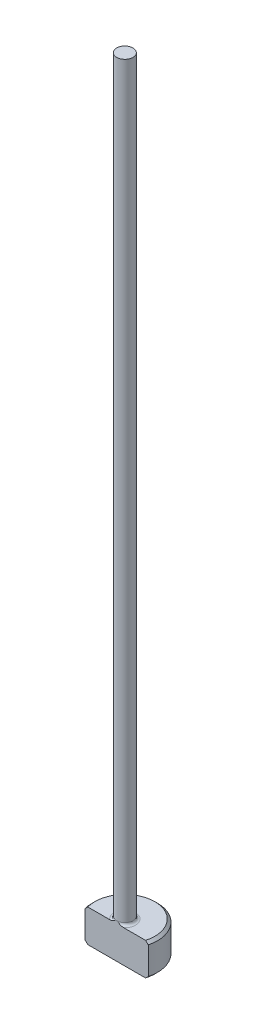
ISO-10303-21;
HEADER;
FILE_DESCRIPTION(('STEP AP214'),'2;1');
FILE_NAME('part.step','',(''),(''),'','','');
FILE_SCHEMA(('AUTOMOTIVE_DESIGN { 1 0 10303 214 1 1 1 1 }'));
ENDSEC;
DATA;
#1=APPLICATION_CONTEXT('core data for automotive mechanical design processes');
#2=APPLICATION_PROTOCOL_DEFINITION('international standard','automotive_design',2000,#1);
#3=PRODUCT_CONTEXT('',#1,'mechanical');
#4=PRODUCT('Part','Part','',(#3));
#5=PRODUCT_RELATED_PRODUCT_CATEGORY('part','',(#4));
#6=PRODUCT_DEFINITION_FORMATION('','',#4);
#7=PRODUCT_DEFINITION_CONTEXT('part definition',#1,'design');
#8=PRODUCT_DEFINITION('design','',#6,#7);
#9=PRODUCT_DEFINITION_SHAPE('','',#8);
#10=(LENGTH_UNIT() NAMED_UNIT(*) SI_UNIT(.MILLI.,.METRE.));
#11=(NAMED_UNIT(*) PLANE_ANGLE_UNIT() SI_UNIT($,.RADIAN.));
#12=(NAMED_UNIT(*) SI_UNIT($,.STERADIAN.) SOLID_ANGLE_UNIT());
#13=UNCERTAINTY_MEASURE_WITH_UNIT(LENGTH_MEASURE(1.E-05),#10,'distance_accuracy_value','');
#14=(GEOMETRIC_REPRESENTATION_CONTEXT(3) GLOBAL_UNCERTAINTY_ASSIGNED_CONTEXT((#13)) GLOBAL_UNIT_ASSIGNED_CONTEXT((#10,
#11,#12)) REPRESENTATION_CONTEXT('',''));
#15=CARTESIAN_POINT('',(0.,0.,0.));
#16=DIRECTION('',(0.,0.,1.));
#17=DIRECTION('',(1.,0.,0.));
#18=AXIS2_PLACEMENT_3D('',#15,#16,#17);
#19=CARTESIAN_POINT('',(0.,0.,0.));
#20=DIRECTION('',(0.,-1.,0.));
#21=DIRECTION('',(0.,0.,-1.));
#22=AXIS2_PLACEMENT_3D('',#19,#20,#21);
#23=PLANE('',#22);
#24=CARTESIAN_POINT('',(0.,0.,0.));
#25=DIRECTION('',(0.,-1.,0.));
#26=DIRECTION('',(0.,0.,-1.));
#27=AXIS2_PLACEMENT_3D('',#24,#25,#26);
#28=CIRCLE('',#27,2.92099999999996);
#29=CARTESIAN_POINT('',(-2.81108554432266,0.,0.793749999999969));
#30=VERTEX_POINT('',#29);
#31=CARTESIAN_POINT('',(2.81108554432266,0.,0.793749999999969));
#32=VERTEX_POINT('',#31);
#33=EDGE_CURVE('E98',#30,#32,#28,.T.);
#34=ORIENTED_EDGE('',*,*,#33,.T.);
#35=DIRECTION('',(-1.,0.,0.));
#36=VECTOR('',#35,1.);
#37=CARTESIAN_POINT('',(-3.07418053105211,0.,0.793749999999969));
#38=LINE('',#37,#36);
#39=EDGE_CURVE('E83',#32,#30,#38,.T.);
#40=ORIENTED_EDGE('',*,*,#39,.T.);
#41=EDGE_LOOP('',(#34,#40));
#42=FACE_BOUND('',#41,.T.);
#43=ADVANCED_FACE('F32',(#42),#23,.T.);
#44=CARTESIAN_POINT('',(0.,259.958771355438,0.));
#45=DIRECTION('',(0.,1.,0.));
#46=DIRECTION('',(0.,0.,1.));
#47=AXIS2_PLACEMENT_3D('',#44,#45,#46);
#48=CYLINDRICAL_SURFACE('',#47,3.17499999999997);
#49=CARTESIAN_POINT('',(0.,2.92099999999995,0.));
#50=DIRECTION('',(0.,1.,0.));
#51=DIRECTION('',(0.,0.,1.));
#52=AXIS2_PLACEMENT_3D('',#49,#50,#51);
#53=CIRCLE('',#52,3.17499999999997);
#54=CARTESIAN_POINT('',(-3.07418053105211,2.92099999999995,0.793749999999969));
#55=VERTEX_POINT('',#54);
#56=CARTESIAN_POINT('',(3.07418053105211,2.92099999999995,0.793749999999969));
#57=VERTEX_POINT('',#56);
#58=EDGE_CURVE('E104',#55,#57,#53,.F.);
#59=ORIENTED_EDGE('',*,*,#58,.T.);
#60=DIRECTION('',(0.,-1.,0.));
#61=VECTOR('',#60,1.);
#62=CARTESIAN_POINT('',(3.07418053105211,76.2,0.793749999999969));
#63=LINE('',#62,#61);
#64=CARTESIAN_POINT('',(3.07418053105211,0.254000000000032,0.793749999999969));
#65=VERTEX_POINT('',#64);
#66=EDGE_CURVE('E183',#57,#65,#63,.T.);
#67=ORIENTED_EDGE('',*,*,#66,.T.);
#68=CARTESIAN_POINT('',(0.,0.254000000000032,0.));
#69=DIRECTION('',(0.,-1.,0.));
#70=DIRECTION('',(0.,0.,-1.));
#71=AXIS2_PLACEMENT_3D('',#68,#69,#70);
#72=CIRCLE('',#71,3.17499999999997);
#73=CARTESIAN_POINT('',(-3.07418053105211,0.254000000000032,0.793749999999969));
#74=VERTEX_POINT('',#73);
#75=EDGE_CURVE('E100',#65,#74,#72,.F.);
#76=ORIENTED_EDGE('',*,*,#75,.T.);
#77=DIRECTION('',(0.,-1.,0.));
#78=VECTOR('',#77,1.);
#79=CARTESIAN_POINT('',(-3.07418053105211,76.2,0.793749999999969));
#80=LINE('',#79,#78);
#81=EDGE_CURVE('E93',#55,#74,#80,.T.);
#82=ORIENTED_EDGE('',*,*,#81,.F.);
#83=EDGE_LOOP('',(#59,#67,#76,#82));
#84=FACE_BOUND('',#83,.T.);
#85=ADVANCED_FACE('F158',(#84),#48,.T.);
#86=CARTESIAN_POINT('',(-3.17499999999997,3.175,0.));
#87=DIRECTION('',(0.,1.,0.));
#88=DIRECTION('',(0.,0.,1.));
#89=AXIS2_PLACEMENT_3D('',#86,#87,#88);
#90=PLANE('',#89);
#91=CARTESIAN_POINT('',(0.,3.175,0.));
#92=DIRECTION('',(0.,1.,0.));
#93=DIRECTION('',(0.,0.,1.));
#94=AXIS2_PLACEMENT_3D('',#91,#92,#93);
#95=CIRCLE('',#94,2.92099999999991);
#96=CARTESIAN_POINT('',(2.81108554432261,3.175,0.793749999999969));
#97=VERTEX_POINT('',#96);
#98=CARTESIAN_POINT('',(-2.81108554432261,3.175,0.793749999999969));
#99=VERTEX_POINT('',#98);
#100=EDGE_CURVE('E178',#97,#99,#95,.T.);
#101=ORIENTED_EDGE('',*,*,#100,.T.);
#102=DIRECTION('',(1.,0.,0.));
#103=VECTOR('',#102,1.);
#104=CARTESIAN_POINT('',(-3.17499999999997,3.175,0.793749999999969));
#105=LINE('',#104,#103);
#106=CARTESIAN_POINT('',(-0.68391593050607,3.17500000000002,0.793749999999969));
#107=VERTEX_POINT('',#106);
#108=EDGE_CURVE('E57',#99,#107,#105,.T.);
#109=ORIENTED_EDGE('',*,*,#108,.T.);
#110=CARTESIAN_POINT('',(0.,3.175,0.));
#111=DIRECTION('',(0.,1.,0.));
#112=DIRECTION('',(0.,0.,1.));
#113=AXIS2_PLACEMENT_3D('',#110,#111,#112);
#114=CIRCLE('',#113,1.04774999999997);
#115=CARTESIAN_POINT('',(0.683915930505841,3.17500000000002,0.793749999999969));
#116=VERTEX_POINT('',#115);
#117=EDGE_CURVE('E107',#107,#116,#114,.F.);
#118=ORIENTED_EDGE('',*,*,#117,.T.);
#119=EDGE_CURVE('E136',#116,#97,#105,.T.);
#120=ORIENTED_EDGE('',*,*,#119,.T.);
#121=EDGE_LOOP('',(#101,#109,#118,#120));
#122=FACE_BOUND('',#121,.T.);
#123=ADVANCED_FACE('F147',(#122),#90,.T.);
#124=CARTESIAN_POINT('',(0.,3.17499999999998,0.));
#125=DIRECTION('',(0.,-1.,0.));
#126=DIRECTION('',(0.,0.,-1.));
#127=AXIS2_PLACEMENT_3D('',#124,#125,#126);
#128=CONICAL_SURFACE('',#127,2.92099999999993,0.78539816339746);
#129=ORIENTED_EDGE('',*,*,#58,.F.);
#130=CARTESIAN_POINT('',(-6.76654378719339,-0.716940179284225,0.793749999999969));
#131=CARTESIAN_POINT('',(-6.58612847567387,-0.537757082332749,0.793749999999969));
#132=CARTESIAN_POINT('',(-6.40566799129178,-0.358619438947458,0.793749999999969));
#133=CARTESIAN_POINT('',(-6.04458522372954,-0.000434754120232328,0.793749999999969));
#134=CARTESIAN_POINT('',(-5.86396291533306,0.178612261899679,0.793749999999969));
#135=CARTESIAN_POINT('',(-5.5018107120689,0.537283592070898,0.793749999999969));
#136=CARTESIAN_POINT('',(-5.32028015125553,0.716907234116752,0.793749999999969));
#137=CARTESIAN_POINT('',(-4.95703332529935,1.07589430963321,0.793749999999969));
#138=CARTESIAN_POINT('',(-4.77531710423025,1.25525778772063,0.793749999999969));
#139=CARTESIAN_POINT('',(-4.30046081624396,1.72319332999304,0.793749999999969));
#140=CARTESIAN_POINT('',(-4.00708464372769,2.0115263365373,0.793749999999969));
#141=CARTESIAN_POINT('',(-3.56582498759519,2.44302479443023,0.793749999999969));
#142=CARTESIAN_POINT('',(-3.41848369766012,2.58674450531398,0.793749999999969));
#143=CARTESIAN_POINT('',(-3.12328201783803,2.87362456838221,0.793749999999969));
#144=CARTESIAN_POINT('',(-2.97542167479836,3.01678496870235,0.793749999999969));
#145=CARTESIAN_POINT('',(-2.67948713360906,3.3017024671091,0.793749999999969));
#146=CARTESIAN_POINT('',(-2.53141613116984,3.44346288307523,0.793749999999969));
#147=CARTESIAN_POINT('',(-2.23395385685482,3.72569854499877,0.793749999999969));
#148=CARTESIAN_POINT('',(-2.08456216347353,3.86617334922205,0.793749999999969));
#149=CARTESIAN_POINT('',(-1.85887536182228,4.07494512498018,0.793749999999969));
#150=CARTESIAN_POINT('',(-1.78343405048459,4.14416382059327,0.793749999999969));
#151=CARTESIAN_POINT('',(-1.63175147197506,4.28171769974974,0.793749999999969));
#152=CARTESIAN_POINT('',(-1.55551023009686,4.35005291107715,0.793749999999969));
#153=CARTESIAN_POINT('',(-1.40191671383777,4.48538182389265,0.793749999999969));
#154=CARTESIAN_POINT('',(-1.32456505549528,4.55237622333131,0.793749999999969));
#155=CARTESIAN_POINT('',(-1.16814829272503,4.68432749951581,0.793749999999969));
#156=CARTESIAN_POINT('',(-1.08908357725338,4.74928483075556,0.793749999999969));
#157=CARTESIAN_POINT('',(-0.97864625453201,4.83605857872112,0.793749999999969));
#158=CARTESIAN_POINT('',(-0.948460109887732,4.85938268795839,0.793749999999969));
#159=CARTESIAN_POINT('',(-0.887614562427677,4.9054118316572,0.793749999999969));
#160=CARTESIAN_POINT('',(-0.85695512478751,4.9281168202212,0.793749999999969));
#161=CARTESIAN_POINT('',(-0.794984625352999,4.97280020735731,0.793749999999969));
#162=CARTESIAN_POINT('',(-0.763672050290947,4.9947765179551,0.793749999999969));
#163=CARTESIAN_POINT('',(-0.700352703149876,5.03770392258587,0.793749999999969));
#164=CARTESIAN_POINT('',(-0.668345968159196,5.05865507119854,0.793749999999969));
#165=CARTESIAN_POINT('',(-0.604596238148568,5.09851389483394,0.793749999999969));
#166=CARTESIAN_POINT('',(-0.572882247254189,5.11746713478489,0.793749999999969));
#167=CARTESIAN_POINT('',(-0.508518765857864,5.15370377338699,0.793749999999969));
#168=CARTESIAN_POINT('',(-0.475868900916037,5.17098649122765,0.793749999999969));
#169=CARTESIAN_POINT('',(-0.37652619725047,5.21937397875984,0.793749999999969));
#170=CARTESIAN_POINT('',(-0.308073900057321,5.24726182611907,0.793749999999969));
#171=CARTESIAN_POINT('',(-0.214532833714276,5.27405975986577,0.793749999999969));
#172=CARTESIAN_POINT('',(-0.191393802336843,5.27981785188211,0.793749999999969));
#173=CARTESIAN_POINT('',(-0.144729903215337,5.28948827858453,0.793749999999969));
#174=CARTESIAN_POINT('',(-0.121204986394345,5.29340037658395,0.793749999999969));
#175=CARTESIAN_POINT('',(-0.0504134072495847,5.30201256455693,0.793749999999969));
#176=CARTESIAN_POINT('',(-0.00272310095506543,5.30365123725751,0.793749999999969));
#177=CARTESIAN_POINT('',(0.0920811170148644,5.29833583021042,0.793749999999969));
#178=CARTESIAN_POINT('',(0.139195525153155,5.2913897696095,0.793749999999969));
#179=CARTESIAN_POINT('',(0.231925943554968,5.2703074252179,0.793749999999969));
#180=CARTESIAN_POINT('',(0.277534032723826,5.25613809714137,0.793749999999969));
#181=CARTESIAN_POINT('',(0.379024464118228,5.21798849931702,0.793749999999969));
#182=CARTESIAN_POINT('',(0.434273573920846,5.1923804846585,0.793749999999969));
#183=CARTESIAN_POINT('',(0.542067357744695,5.13591410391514,0.793749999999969));
#184=CARTESIAN_POINT('',(0.594605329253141,5.10504346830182,0.793749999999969));
#185=CARTESIAN_POINT('',(0.697964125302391,5.03978970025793,0.793749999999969));
#186=CARTESIAN_POINT('',(0.748769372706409,5.00538227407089,0.793749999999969));
#187=CARTESIAN_POINT('',(0.848768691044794,4.93444453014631,0.793749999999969));
#188=CARTESIAN_POINT('',(0.897964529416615,4.89791667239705,0.793749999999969));
#189=CARTESIAN_POINT('',(1.00110200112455,4.81888727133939,0.793749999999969));
#190=CARTESIAN_POINT('',(1.05489843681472,4.77619738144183,0.793749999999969));
#191=CARTESIAN_POINT('',(1.1614670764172,4.68955385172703,0.793749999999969));
#192=CARTESIAN_POINT('',(1.21423916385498,4.64560006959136,0.793749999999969));
#193=CARTESIAN_POINT('',(1.37147314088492,4.51238432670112,0.793749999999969));
#194=CARTESIAN_POINT('',(1.47481171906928,4.42180042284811,0.793749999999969));
#195=CARTESIAN_POINT('',(1.6799072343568,4.23856991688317,0.793749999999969));
#196=CARTESIAN_POINT('',(1.78166152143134,4.14592038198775,0.793749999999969));
#197=CARTESIAN_POINT('',(1.98403605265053,3.95943864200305,0.793749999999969));
#198=CARTESIAN_POINT('',(2.08465655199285,3.86560671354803,0.793749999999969));
#199=CARTESIAN_POINT('',(2.28470036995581,3.67758310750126,0.793749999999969));
#200=CARTESIAN_POINT('',(2.38412704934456,3.58339499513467,0.793749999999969));
#201=CARTESIAN_POINT('',(2.58246726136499,3.39446890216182,0.793749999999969));
#202=CARTESIAN_POINT('',(2.68138076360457,3.29973088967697,0.793749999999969));
#203=CARTESIAN_POINT('',(2.97740330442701,3.01509017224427,0.793749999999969));
#204=CARTESIAN_POINT('',(3.17395519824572,2.82460855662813,0.793749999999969));
#205=CARTESIAN_POINT('',(3.65457059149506,2.35679110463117,0.793749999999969));
#206=CARTESIAN_POINT('',(3.93817207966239,2.078981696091,0.793749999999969));
#207=CARTESIAN_POINT('',(4.5045437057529,1.52234859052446,0.793749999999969));
#208=CARTESIAN_POINT('',(4.78731356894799,1.24352461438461,0.793749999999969));
#209=CARTESIAN_POINT('',(5.35306828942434,0.684582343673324,0.793749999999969));
#210=CARTESIAN_POINT('',(5.63605169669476,0.404462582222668,0.793749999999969));
#211=CARTESIAN_POINT('',(6.20156797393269,-0.156054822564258,0.793749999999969));
#212=CARTESIAN_POINT('',(6.48410095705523,-0.436452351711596,0.793749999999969));
#213=CARTESIAN_POINT('',(6.76654378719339,-0.716940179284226,0.793749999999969));
#214=B_SPLINE_CURVE_WITH_KNOTS('',3,(#130,#131,#132,#133,#134,#135,#136,#137,#138,#139,#140,
#141,#142,#143,#144,#145,#146,#147,#148,#149,#150,#151,#152,#153,#154,#155,#156,#157,#158,#159,
#160,#161,#162,#163,#164,#165,#166,#167,#168,#169,#170,#171,#172,#173,#174,#175,#176,#177,#178,
#179,#180,#181,#182,#183,#184,#185,#186,#187,#188,#189,#190,#191,#192,#193,#194,#195,#196,#197,
#198,#199,#200,#201,#202,#203,#204,#205,#206,#207,#208,#209,#210,#211,#212,#213),.UNSPECIFIED.,
.F.,.F.,(4,2,2,2,2,2,2,2,2,2,2,2,2,2,2,2,2,2,2,2,2,2,2,2,2,2,2,2,2,2,2,2,2,2,2,2,2,2,2,2,2,4),
(0.,0.762827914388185,1.52580903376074,2.29194326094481,3.05792523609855,4.29195946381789,
4.90944009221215,5.52686635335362,6.14183419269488,6.75700594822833,7.06415568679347,
7.37129574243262,7.67827152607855,7.98517832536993,8.09961411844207,8.2140583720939,
8.32880631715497,8.4435481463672,8.55433096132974,8.66515873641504,8.8854990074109,
8.95696802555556,9.02844620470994,9.17076254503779,9.31294604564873,9.45578590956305,
9.63799856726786,9.82064200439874,10.0046365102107,10.1884216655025,10.3944233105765,
10.6004482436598,11.0126549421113,11.4254897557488,11.8382297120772,12.249096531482,
12.6599874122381,13.4811048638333,14.6720966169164,15.8634454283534,17.0579826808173,
18.2521466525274),.UNSPECIFIED.);
#215=EDGE_CURVE('E135',#55,#99,#214,.T.);
#216=ORIENTED_EDGE('',*,*,#215,.T.);
#217=ORIENTED_EDGE('',*,*,#100,.F.);
#218=EDGE_CURVE('E127',#97,#57,#214,.T.);
#219=ORIENTED_EDGE('',*,*,#218,.T.);
#220=EDGE_LOOP('',(#129,#216,#217,#219));
#221=FACE_BOUND('',#220,.T.);
#222=ADVANCED_FACE('F143',(#221),#128,.T.);
#223=CARTESIAN_POINT('',(0.,0.254000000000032,0.));
#224=DIRECTION('',(0.,1.,0.));
#225=DIRECTION('',(0.,0.,1.));
#226=AXIS2_PLACEMENT_3D('',#223,#224,#225);
#227=CONICAL_SURFACE('',#226,3.17499999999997,0.785398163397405);
#228=ORIENTED_EDGE('',*,*,#75,.F.);
#229=CARTESIAN_POINT('',(6.76654378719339,3.89194017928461,0.793749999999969));
#230=CARTESIAN_POINT('',(6.5861284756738,3.71275708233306,0.793749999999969));
#231=CARTESIAN_POINT('',(6.40566799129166,3.53361943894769,0.793749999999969));
#232=CARTESIAN_POINT('',(6.0445852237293,3.1754347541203,0.793749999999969));
#233=CARTESIAN_POINT('',(5.86396291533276,2.99638773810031,0.793749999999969));
#234=CARTESIAN_POINT('',(5.50181071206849,2.63771640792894,0.793749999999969));
#235=CARTESIAN_POINT('',(5.32028015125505,2.458092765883,0.793749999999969));
#236=CARTESIAN_POINT('',(4.95703332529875,2.09910569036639,0.793749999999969));
#237=CARTESIAN_POINT('',(4.77531710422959,1.91974221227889,0.793749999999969));
#238=CARTESIAN_POINT('',(4.30046081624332,1.45180667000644,0.793749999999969));
#239=CARTESIAN_POINT('',(4.00708464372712,1.16347366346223,0.793749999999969));
#240=CARTESIAN_POINT('',(3.56582498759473,0.731975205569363,0.793749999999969));
#241=CARTESIAN_POINT('',(3.41848369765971,0.588255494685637,0.793749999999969));
#242=CARTESIAN_POINT('',(3.12328201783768,0.301375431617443,0.793749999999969));
#243=CARTESIAN_POINT('',(2.97542167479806,0.158215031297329,0.793749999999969));
#244=CARTESIAN_POINT('',(2.67948713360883,-0.126702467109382,0.793749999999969));
#245=CARTESIAN_POINT('',(2.53141613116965,-0.268462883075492,0.793749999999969));
#246=CARTESIAN_POINT('',(2.2339538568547,-0.550698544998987,0.793749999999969));
#247=CARTESIAN_POINT('',(2.08456216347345,-0.691173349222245,0.793749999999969));
#248=CARTESIAN_POINT('',(1.85887536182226,-0.899945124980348,0.793749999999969));
#249=CARTESIAN_POINT('',(1.78343405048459,-0.969163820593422,0.793749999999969));
#250=CARTESIAN_POINT('',(1.63175147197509,-1.10671769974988,0.793749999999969));
#251=CARTESIAN_POINT('',(1.55551023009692,-1.17505291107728,0.793749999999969));
#252=CARTESIAN_POINT('',(1.40191671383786,-1.31038182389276,0.793749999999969));
#253=CARTESIAN_POINT('',(1.32456505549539,-1.37737622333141,0.793749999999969));
#254=CARTESIAN_POINT('',(1.16814829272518,-1.5093274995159,0.793749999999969));
#255=CARTESIAN_POINT('',(1.08908357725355,-1.57428483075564,0.793749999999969));
#256=CARTESIAN_POINT('',(0.978646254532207,-1.6610585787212,0.793749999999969));
#257=CARTESIAN_POINT('',(0.948460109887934,-1.68438268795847,0.793749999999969));
#258=CARTESIAN_POINT('',(0.887614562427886,-1.73041183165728,0.793749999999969));
#259=CARTESIAN_POINT('',(0.856955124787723,-1.75311682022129,0.793749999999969));
#260=CARTESIAN_POINT('',(0.79498462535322,-1.7978002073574,0.793749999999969));
#261=CARTESIAN_POINT('',(0.763672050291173,-1.81977651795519,0.793749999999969));
#262=CARTESIAN_POINT('',(0.700352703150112,-1.86270392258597,0.793749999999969));
#263=CARTESIAN_POINT('',(0.668345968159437,-1.88365507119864,0.793749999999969));
#264=CARTESIAN_POINT('',(0.604596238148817,-1.92351389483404,0.793749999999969));
#265=CARTESIAN_POINT('',(0.572882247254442,-1.942467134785,0.793749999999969));
#266=CARTESIAN_POINT('',(0.508518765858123,-1.97870377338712,0.793749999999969));
#267=CARTESIAN_POINT('',(0.475868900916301,-1.99598649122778,0.793749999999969));
#268=CARTESIAN_POINT('',(0.376526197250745,-2.04437397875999,0.793749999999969));
#269=CARTESIAN_POINT('',(0.308073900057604,-2.07226182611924,0.793749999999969));
#270=CARTESIAN_POINT('',(0.214532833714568,-2.09905975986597,0.793749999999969));
#271=CARTESIAN_POINT('',(0.191393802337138,-2.10481785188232,0.793749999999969));
#272=CARTESIAN_POINT('',(0.144729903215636,-2.11448827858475,0.793749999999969));
#273=CARTESIAN_POINT('',(0.121204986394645,-2.11840037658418,0.793749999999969));
#274=CARTESIAN_POINT('',(0.0504134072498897,-2.12701256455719,0.793749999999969));
#275=CARTESIAN_POINT('',(0.00272310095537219,-2.12865123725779,0.793749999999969));
#276=CARTESIAN_POINT('',(-0.092081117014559,-2.12333583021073,0.793749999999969));
#277=CARTESIAN_POINT('',(-0.139195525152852,-2.11638976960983,0.793749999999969));
#278=CARTESIAN_POINT('',(-0.231925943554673,-2.09530742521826,0.793749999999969));
#279=CARTESIAN_POINT('',(-0.277534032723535,-2.08113809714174,0.793749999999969));
#280=CARTESIAN_POINT('',(-0.379024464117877,-2.04298849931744,0.793749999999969));
#281=CARTESIAN_POINT('',(-0.434273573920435,-2.01738048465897,0.793749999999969));
#282=CARTESIAN_POINT('',(-0.542067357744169,-1.9609141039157,0.793749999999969));
#283=CARTESIAN_POINT('',(-0.594605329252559,-1.93004346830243,0.793749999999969));
#284=CARTESIAN_POINT('',(-0.6979641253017,-1.86478970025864,0.793749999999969));
#285=CARTESIAN_POINT('',(-0.748769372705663,-1.83038227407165,0.793749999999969));
#286=CARTESIAN_POINT('',(-0.848768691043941,-1.75944453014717,0.793749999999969));
#287=CARTESIAN_POINT('',(-0.897964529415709,-1.72291667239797,0.793749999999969));
#288=CARTESIAN_POINT('',(-1.00110200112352,-1.64388727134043,0.793749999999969));
#289=CARTESIAN_POINT('',(-1.05489843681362,-1.60119738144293,0.793749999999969));
#290=CARTESIAN_POINT('',(-1.16146707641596,-1.51455385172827,0.793749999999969));
#291=CARTESIAN_POINT('',(-1.21423916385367,-1.47060006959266,0.793749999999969));
#292=CARTESIAN_POINT('',(-1.3714731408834,-1.33738432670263,0.793749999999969));
#293=CARTESIAN_POINT('',(-1.47481171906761,-1.24680042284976,0.793749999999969));
#294=CARTESIAN_POINT('',(-1.67990723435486,-1.06356991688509,0.793749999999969));
#295=CARTESIAN_POINT('',(-1.78166152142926,-0.970920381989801,0.793749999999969));
#296=CARTESIAN_POINT('',(-1.98403605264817,-0.784438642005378,0.793749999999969));
#297=CARTESIAN_POINT('',(-2.08465655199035,-0.690606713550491,0.793749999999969));
#298=CARTESIAN_POINT('',(-2.28470036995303,-0.502583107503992,0.793749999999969));
#299=CARTESIAN_POINT('',(-2.38412704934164,-0.408394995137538,0.793749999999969));
#300=CARTESIAN_POINT('',(-2.58246726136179,-0.219468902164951,0.793749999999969));
#301=CARTESIAN_POINT('',(-2.68138076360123,-0.124730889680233,0.793749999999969));
#302=CARTESIAN_POINT('',(-2.97740330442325,0.159909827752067,0.793749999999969));
#303=CARTESIAN_POINT('',(-3.17395519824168,0.350391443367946,0.793749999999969));
#304=CARTESIAN_POINT('',(-3.65457059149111,0.818208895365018,0.793749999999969));
#305=CARTESIAN_POINT('',(-3.93817207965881,1.09601830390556,0.793749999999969));
#306=CARTESIAN_POINT('',(-4.50454370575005,1.65265140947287,0.793749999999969));
#307=CARTESIAN_POINT('',(-4.78731356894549,1.9314753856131,0.793749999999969));
#308=CARTESIAN_POINT('',(-5.35306828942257,2.49041765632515,0.793749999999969));
#309=CARTESIAN_POINT('',(-5.63605169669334,2.77053741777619,0.793749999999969));
#310=CARTESIAN_POINT('',(-6.20156797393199,3.33105482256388,0.793749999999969));
#311=CARTESIAN_POINT('',(-6.48410095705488,3.6114523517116,0.793749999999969));
#312=CARTESIAN_POINT('',(-6.76654378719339,3.89194017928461,0.793749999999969));
#313=B_SPLINE_CURVE_WITH_KNOTS('',3,(#229,#230,#231,#232,#233,#234,#235,#236,#237,#238,#239,
#240,#241,#242,#243,#244,#245,#246,#247,#248,#249,#250,#251,#252,#253,#254,#255,#256,#257,#258,
#259,#260,#261,#262,#263,#264,#265,#266,#267,#268,#269,#270,#271,#272,#273,#274,#275,#276,#277,
#278,#279,#280,#281,#282,#283,#284,#285,#286,#287,#288,#289,#290,#291,#292,#293,#294,#295,#296,
#297,#298,#299,#300,#301,#302,#303,#304,#305,#306,#307,#308,#309,#310,#311,#312),.UNSPECIFIED.,
.F.,.F.,(4,2,2,2,2,2,2,2,2,2,2,2,2,2,2,2,2,2,2,2,2,2,2,2,2,2,2,2,2,2,2,2,2,2,2,2,2,2,2,2,2,4),
(0.,0.762827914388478,1.52580903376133,2.29194326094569,3.05792523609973,4.29195946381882,
4.90944009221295,5.5268663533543,6.14183419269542,6.75700594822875,7.06415568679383,
7.37129574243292,7.6782715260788,7.98517832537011,8.09961411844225,8.21405837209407,
8.32880631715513,8.44354814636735,8.55433096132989,8.66515873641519,8.88549900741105,
8.95696802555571,9.02844620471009,9.17076254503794,9.31294604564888,9.4557859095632,
9.6379985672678,9.82064200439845,10.0046365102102,10.1884216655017,10.3944233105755,
10.6004482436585,11.0126549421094,11.4254897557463,11.8382297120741,12.2490965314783,
12.6599874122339,13.4811048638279,14.6720966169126,15.8634454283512,17.0579826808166,
18.2521466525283),.UNSPECIFIED.);
#314=EDGE_CURVE('E86',#65,#32,#313,.T.);
#315=ORIENTED_EDGE('',*,*,#314,.T.);
#316=ORIENTED_EDGE('',*,*,#33,.F.);
#317=EDGE_CURVE('E89',#30,#74,#313,.T.);
#318=ORIENTED_EDGE('',*,*,#317,.T.);
#319=EDGE_LOOP('',(#228,#315,#316,#318));
#320=FACE_BOUND('',#319,.T.);
#321=ADVANCED_FACE('F97',(#320),#227,.T.);
#322=CARTESIAN_POINT('',(0.,3.42900000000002,0.));
#323=DIRECTION('',(0.,1.,0.));
#324=DIRECTION('',(0.,0.,1.));
#325=AXIS2_PLACEMENT_3D('',#322,#323,#324);
#326=TOROIDAL_SURFACE('',#325,1.04774999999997,0.254);
#327=CARTESIAN_POINT('',(0.,3.42900000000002,0.793749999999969));
#328=CARTESIAN_POINT('',(1.00594079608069E-09,3.42900059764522,0.793749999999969));
#329=CARTESIAN_POINT('',(8.25543157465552E-08,3.42900119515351,0.793749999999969));
#330=CARTESIAN_POINT('',(3.59845202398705E-07,3.42900236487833,0.793749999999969));
#331=CARTESIAN_POINT('',(5.56611928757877E-07,3.42900293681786,0.793749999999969));
#332=CARTESIAN_POINT('',(1.03793284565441E-06,3.4290040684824,0.793749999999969));
#333=CARTESIAN_POINT('',(1.32565590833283E-06,3.42900462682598,0.793749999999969));
#334=CARTESIAN_POINT('',(1.96199956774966E-06,3.42900570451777,0.793749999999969));
#335=CARTESIAN_POINT('',(2.31046733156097E-06,3.42900622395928,0.793749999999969));
#336=CARTESIAN_POINT('',(3.51238455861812E-06,3.42900787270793,0.793749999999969));
#337=CARTESIAN_POINT('',(4.44738387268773E-06,3.42900894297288,0.793749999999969));
#338=CARTESIAN_POINT('',(6.43338758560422E-06,3.42901092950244,0.793749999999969));
#339=CARTESIAN_POINT('',(7.48242245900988E-06,3.42901184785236,0.793749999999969));
#340=CARTESIAN_POINT('',(1.1352686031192E-05,3.42901504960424,0.793749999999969));
#341=CARTESIAN_POINT('',(1.43190067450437E-05,3.42901716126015,0.793749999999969));
#342=CARTESIAN_POINT('',(2.0344879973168E-05,3.42902083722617,0.793749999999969));
#343=CARTESIAN_POINT('',(2.33909441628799E-05,3.42902242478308,0.793749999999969));
#344=CARTESIAN_POINT('',(3.56627691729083E-05,3.42902869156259,0.793749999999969));
#345=CARTESIAN_POINT('',(4.4989192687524E-05,3.42903316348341,0.793749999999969));
#346=CARTESIAN_POINT('',(6.2853777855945E-05,3.42904079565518,0.793749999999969));
#347=CARTESIAN_POINT('',(7.13510645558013E-05,3.42904404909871,0.793749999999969));
#348=CARTESIAN_POINT('',(0.000129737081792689,3.42906834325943,0.793749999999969));
#349=CARTESIAN_POINT('',(0.00017577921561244,3.42909753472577,0.793749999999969));
#350=CARTESIAN_POINT('',(0.000350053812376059,3.42920359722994,0.793749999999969));
#351=CARTESIAN_POINT('',(0.00048099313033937,3.42927442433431,0.793749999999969));
#352=CARTESIAN_POINT('',(0.000972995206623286,3.42954494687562,0.793749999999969));
#353=CARTESIAN_POINT('',(0.00133127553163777,3.4297509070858,0.793749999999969));
#354=CARTESIAN_POINT('',(0.00275914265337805,3.43056728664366,0.793749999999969));
#355=CARTESIAN_POINT('',(0.00383182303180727,3.43117068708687,0.793749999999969));
#356=CARTESIAN_POINT('',(0.0249852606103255,3.44307504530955,0.793749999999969));
#357=CARTESIAN_POINT('',(0.0450341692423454,3.45445024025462,0.793749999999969));
#358=CARTESIAN_POINT('',(0.0846093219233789,3.47663493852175,0.793749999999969));
#359=CARTESIAN_POINT('',(0.10413206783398,3.48745096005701,0.793749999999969));
#360=CARTESIAN_POINT('',(0.145314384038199,3.50987127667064,0.793749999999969));
#361=CARTESIAN_POINT('',(0.166990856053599,3.52144503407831,0.793749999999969));
#362=CARTESIAN_POINT('',(0.210829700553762,3.54412234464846,0.793749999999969));
#363=CARTESIAN_POINT('',(0.232994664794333,3.55522089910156,0.793749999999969));
#364=CARTESIAN_POINT('',(0.289745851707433,3.58237702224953,0.793749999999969));
#365=CARTESIAN_POINT('',(0.324598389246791,3.59788963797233,0.793749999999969));
#366=CARTESIAN_POINT('',(0.394732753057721,3.62578193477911,0.793749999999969));
#367=CARTESIAN_POINT('',(0.429990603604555,3.63822002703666,0.793749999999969));
#368=CARTESIAN_POINT('',(0.486020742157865,3.65466140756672,0.793749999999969));
#369=CARTESIAN_POINT('',(0.506403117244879,3.65997735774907,0.793749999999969));
#370=CARTESIAN_POINT('',(0.547581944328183,3.66916489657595,0.793749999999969));
#371=CARTESIAN_POINT('',(0.568379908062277,3.67302947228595,0.793749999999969));
#372=CARTESIAN_POINT('',(0.632823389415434,3.68222555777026,0.793749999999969));
#373=CARTESIAN_POINT('',(0.677005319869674,3.6846711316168,0.793749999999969));
#374=CARTESIAN_POINT('',(0.74175190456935,3.68045811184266,0.793749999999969));
#375=CARTESIAN_POINT('',(0.762598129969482,3.67788777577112,0.793749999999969));
#376=CARTESIAN_POINT('',(0.803620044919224,3.66996519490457,0.793749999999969));
#377=CARTESIAN_POINT('',(0.823799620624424,3.66463419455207,0.793749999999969));
#378=CARTESIAN_POINT('',(0.863382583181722,3.65071566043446,0.793749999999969));
#379=CARTESIAN_POINT('',(0.882769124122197,3.64207900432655,0.793749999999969));
#380=CARTESIAN_POINT('',(0.919550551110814,3.62121223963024,0.793749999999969));
#381=CARTESIAN_POINT('',(0.936947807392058,3.6089864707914,0.793749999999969));
#382=CARTESIAN_POINT('',(0.962807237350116,3.5859668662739,0.793749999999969));
#383=CARTESIAN_POINT('',(0.972229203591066,3.57624640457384,0.793749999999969));
#384=CARTESIAN_POINT('',(0.989372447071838,3.55540033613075,0.793749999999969));
#385=CARTESIAN_POINT('',(0.997095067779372,3.54427585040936,0.793749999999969));
#386=CARTESIAN_POINT('',(1.01049428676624,3.52073386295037,0.793749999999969));
#387=CARTESIAN_POINT('',(1.01615519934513,3.50830733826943,0.793749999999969));
#388=CARTESIAN_POINT('',(1.02498233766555,3.48259444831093,0.793749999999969));
#389=CARTESIAN_POINT('',(1.02815025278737,3.46930867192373,0.793749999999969));
#390=CARTESIAN_POINT('',(1.03155096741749,3.44397291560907,0.793749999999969));
#391=CARTESIAN_POINT('',(1.03208709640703,3.43196305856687,0.793749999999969));
#392=CARTESIAN_POINT('',(1.03101637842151,3.40804163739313,0.793749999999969));
#393=CARTESIAN_POINT('',(1.02941018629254,3.39613004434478,0.793749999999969));
#394=CARTESIAN_POINT('',(1.02428560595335,3.37336758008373,0.793749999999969));
#395=CARTESIAN_POINT('',(1.02086846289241,3.36249356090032,0.793749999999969));
#396=CARTESIAN_POINT('',(1.01236081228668,3.34142542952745,0.793749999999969));
#397=CARTESIAN_POINT('',(1.00727011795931,3.33123139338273,0.793749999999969));
#398=CARTESIAN_POINT('',(0.995273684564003,3.31111130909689,0.793749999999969));
#399=CARTESIAN_POINT('',(0.988275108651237,3.30124089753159,0.793749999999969));
#400=CARTESIAN_POINT('',(0.972923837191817,3.28262339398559,0.793749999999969));
#401=CARTESIAN_POINT('',(0.964570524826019,3.27387681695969,0.793749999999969));
#402=CARTESIAN_POINT('',(0.943078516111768,3.25417715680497,0.793749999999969));
#403=CARTESIAN_POINT('',(0.929393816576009,3.24381776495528,0.793749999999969));
#404=CARTESIAN_POINT('',(0.900512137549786,3.2254571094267,0.793749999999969));
#405=CARTESIAN_POINT('',(0.885311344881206,3.21746200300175,0.793749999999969));
#406=CARTESIAN_POINT('',(0.848269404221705,3.20122250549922,0.793749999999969));
#407=CARTESIAN_POINT('',(0.826012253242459,3.19393028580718,0.793749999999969));
#408=CARTESIAN_POINT('',(0.780723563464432,3.18300053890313,0.793749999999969));
#409=CARTESIAN_POINT('',(0.75769381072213,3.17935511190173,0.793749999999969));
#410=CARTESIAN_POINT('',(0.699883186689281,3.17409624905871,0.793749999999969));
#411=CARTESIAN_POINT('',(0.664934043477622,3.17438476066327,0.793749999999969));
#412=CARTESIAN_POINT('',(0.594912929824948,3.18030030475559,0.793749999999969));
#413=CARTESIAN_POINT('',(0.559851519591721,3.18602988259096,0.793749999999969));
#414=CARTESIAN_POINT('',(0.482838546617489,3.20336698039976,0.793749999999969));
#415=CARTESIAN_POINT('',(0.44112931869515,3.2160134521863,0.793749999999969));
#416=CARTESIAN_POINT('',(0.359235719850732,3.24555160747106,0.793749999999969));
#417=CARTESIAN_POINT('',(0.319054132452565,3.26245064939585,0.793749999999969));
#418=CARTESIAN_POINT('',(0.243269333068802,3.29746035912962,0.793749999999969));
#419=CARTESIAN_POINT('',(0.207563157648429,3.31535360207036,0.793749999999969));
#420=CARTESIAN_POINT('',(0.137215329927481,3.35230149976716,0.793749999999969));
#421=CARTESIAN_POINT('',(0.102566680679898,3.37134307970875,0.793749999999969));
#422=CARTESIAN_POINT('',(0.058815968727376,3.39581599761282,0.793749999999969));
#423=CARTESIAN_POINT('',(0.0495777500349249,3.4010080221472,0.793749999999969));
#424=CARTESIAN_POINT('',(0.0342003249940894,3.40966841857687,0.793749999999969));
#425=CARTESIAN_POINT('',(0.0280584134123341,3.41313227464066,0.793749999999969));
#426=CARTESIAN_POINT('',(0.0162490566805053,3.41981335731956,0.793749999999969));
#427=CARTESIAN_POINT('',(0.0105810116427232,3.4230293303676,0.793749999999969));
#428=CARTESIAN_POINT('',(0.00384046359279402,3.42682478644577,0.793749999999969));
#429=CARTESIAN_POINT('',(0.00277621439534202,3.42742318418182,0.793749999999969));
#430=CARTESIAN_POINT('',(0.00135061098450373,3.42823816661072,0.793749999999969));
#431=CARTESIAN_POINT('',(0.000986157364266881,3.42844769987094,0.793749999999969));
#432=CARTESIAN_POINT('',(0.000486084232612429,3.42872264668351,0.793749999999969));
#433=CARTESIAN_POINT('',(0.000353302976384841,3.42879446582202,0.793749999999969));
#434=CARTESIAN_POINT('',(0.000176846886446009,3.42890187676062,0.793749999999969));
#435=CARTESIAN_POINT('',(0.000130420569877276,3.42893131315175,0.793749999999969));
#436=CARTESIAN_POINT('',(7.15678594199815E-05,3.42895575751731,0.793749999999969));
#437=CARTESIAN_POINT('',(6.30330597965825E-05,3.42895901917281,0.793749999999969));
#438=CARTESIAN_POINT('',(4.50899390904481E-05,3.42896668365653,0.793749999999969));
#439=CARTESIAN_POINT('',(3.5723396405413E-05,3.42897118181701,0.793749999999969));
#440=CARTESIAN_POINT('',(2.34063299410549E-05,3.42897748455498,0.793749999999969));
#441=CARTESIAN_POINT('',(2.03534438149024E-05,3.42897907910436,0.793749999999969));
#442=CARTESIAN_POINT('',(1.43153651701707E-05,3.42898277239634,0.793749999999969));
#443=CARTESIAN_POINT('',(1.13438162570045E-05,3.42898489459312,0.793749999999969));
#444=CARTESIAN_POINT('',(7.46894567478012E-06,3.42898811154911,0.793749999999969));
#445=CARTESIAN_POINT('',(6.41931601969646E-06,3.42898903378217,0.793749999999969));
#446=CARTESIAN_POINT('',(4.43292994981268E-06,3.42899102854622,0.793749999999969));
#447=CARTESIAN_POINT('',(3.49816033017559E-06,3.42899210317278,0.793749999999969));
#448=CARTESIAN_POINT('',(2.29751703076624E-06,3.42899375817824,0.793749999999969));
#449=CARTESIAN_POINT('',(1.94960797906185E-06,3.42899427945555,0.793749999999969));
#450=CARTESIAN_POINT('',(1.3146993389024E-06,3.42899536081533,0.793749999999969));
#451=CARTESIAN_POINT('',(1.02785383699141E-06,3.42899592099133,0.793749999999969));
#452=CARTESIAN_POINT('',(5.48672660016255E-07,3.42899705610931,0.793749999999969));
#453=CARTESIAN_POINT('',(3.53146209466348E-07,3.42899762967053,0.793749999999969));
#454=CARTESIAN_POINT('',(7.8821997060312E-08,3.42899880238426,0.793749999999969));
#455=CARTESIAN_POINT('',(-1.0077821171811E-09,3.42899940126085,0.793749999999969));
#456=CARTESIAN_POINT('',(0.,3.42900000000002,0.793749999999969));
#457=B_SPLINE_CURVE_WITH_KNOTS('',3,(#327,#328,#329,#330,#331,#332,#333,#334,#335,#336,#337,
#338,#339,#340,#341,#342,#343,#344,#345,#346,#347,#348,#349,#350,#351,#352,#353,#354,#355,#356,
#357,#358,#359,#360,#361,#362,#363,#364,#365,#366,#367,#368,#369,#370,#371,#372,#373,#374,#375,
#376,#377,#378,#379,#380,#381,#382,#383,#384,#385,#386,#387,#388,#389,#390,#391,#392,#393,#394,
#395,#396,#397,#398,#399,#400,#401,#402,#403,#404,#405,#406,#407,#408,#409,#410,#411,#412,#413,
#414,#415,#416,#417,#418,#419,#420,#421,#422,#423,#424,#425,#426,#427,#428,#429,#430,#431,#432,
#433,#434,#435,#436,#437,#438,#439,#440,#441,#442,#443,#444,#445,#446,#447,#448,#449,#450,#451,
#452,#453,#454,#455,#456),.UNSPECIFIED.,.T.,.F.,(4,2,2,2,2,2,2,2,2,2,2,2,2,2,2,2,2,2,2,2,2,2,2,
2,2,2,2,2,2,2,2,2,2,2,2,2,2,2,2,2,2,2,2,2,2,2,2,2,2,2,2,2,2,2,2,2,2,2,2,2,2,2,2,2,4),(0.,
1.79102258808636E-06,3.59821320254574E-06,5.47699485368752E-06,7.35111599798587E-06,
1.15941335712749E-05,1.57729445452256E-05,2.66507184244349E-05,3.69462646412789E-05,
6.79598041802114E-05,9.52269114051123E-05,0.000257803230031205,0.000705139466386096,
0.00194403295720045,0.00563714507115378,0.0747790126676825,0.141736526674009,0.215448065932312,
0.289804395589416,0.404169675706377,0.516158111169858,0.579297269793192,0.642737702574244,
0.774347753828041,0.837211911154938,0.899599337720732,0.962952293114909,1.02622895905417,
1.06668820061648,1.10711534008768,1.14784392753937,1.18854489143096,1.22442273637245,
1.26028961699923,1.29433514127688,1.32838446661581,1.36454119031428,1.40071442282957,
1.45192108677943,1.5032599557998,1.57313432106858,1.64285699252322,1.74712810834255,
1.85340420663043,1.98380168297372,2.11442636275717,2.23419481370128,2.35279155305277,
2.3845831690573,2.40573793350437,2.42528567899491,2.42894945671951,2.43020971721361,
2.4306633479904,2.43082727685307,2.4308546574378,2.43088581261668,2.43089613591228,
2.43090704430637,2.4309112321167,2.43091548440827,2.4309173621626,2.43091924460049,
2.43092105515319,2.43092284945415),.UNSPECIFIED.);
#458=CARTESIAN_POINT('',(0.,3.42900000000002,0.793749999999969));
#459=VERTEX_POINT('',#458);
#460=EDGE_CURVE('E11',#116,#459,#457,.T.);
#461=ORIENTED_EDGE('',*,*,#460,.F.);
#462=ORIENTED_EDGE('',*,*,#117,.F.);
#463=CARTESIAN_POINT('',(0.,3.42900000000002,0.793749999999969));
#464=CARTESIAN_POINT('',(-1.00594083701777E-09,3.42899940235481,0.793749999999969));
#465=CARTESIAN_POINT('',(-8.25543157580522E-08,3.42899880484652,0.793749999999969));
#466=CARTESIAN_POINT('',(-3.59845202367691E-07,3.4289976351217,0.793749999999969));
#467=CARTESIAN_POINT('',(-5.56611928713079E-07,3.42899706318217,0.793749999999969));
#468=CARTESIAN_POINT('',(-1.03793284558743E-06,3.42899593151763,0.793749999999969));
#469=CARTESIAN_POINT('',(-1.32565590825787E-06,3.42899537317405,0.793749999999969));
#470=CARTESIAN_POINT('',(-1.96199956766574E-06,3.42899429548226,0.793749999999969));
#471=CARTESIAN_POINT('',(-2.31046733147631E-06,3.42899377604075,0.793749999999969));
#472=CARTESIAN_POINT('',(-3.51238455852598E-06,3.4289921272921,0.793749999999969));
#473=CARTESIAN_POINT('',(-4.4473838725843E-06,3.42899105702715,0.793749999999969));
#474=CARTESIAN_POINT('',(-6.43338758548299E-06,3.42898907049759,0.793749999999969));
#475=CARTESIAN_POINT('',(-7.48242245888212E-06,3.42898815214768,0.793749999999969));
#476=CARTESIAN_POINT('',(-1.1352686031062E-05,3.42898495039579,0.793749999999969));
#477=CARTESIAN_POINT('',(-1.43190067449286E-05,3.42898283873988,0.793749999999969));
#478=CARTESIAN_POINT('',(-2.03448799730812E-05,3.42897916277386,0.793749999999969));
#479=CARTESIAN_POINT('',(-2.33909441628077E-05,3.42897757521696,0.793749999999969));
#480=CARTESIAN_POINT('',(-3.56627691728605E-05,3.42897130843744,0.793749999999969));
#481=CARTESIAN_POINT('',(-4.49891926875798E-05,3.42896683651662,0.793749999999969));
#482=CARTESIAN_POINT('',(-6.28537778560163E-05,3.42895920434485,0.793749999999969));
#483=CARTESIAN_POINT('',(-7.13510645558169E-05,3.42895595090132,0.793749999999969));
#484=CARTESIAN_POINT('',(-0.000129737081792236,3.4289316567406,0.793749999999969));
#485=CARTESIAN_POINT('',(-0.000175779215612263,3.42890246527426,0.793749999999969));
#486=CARTESIAN_POINT('',(-0.000350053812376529,3.42879640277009,0.793749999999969));
#487=CARTESIAN_POINT('',(-0.000480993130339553,3.42872557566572,0.793749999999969));
#488=CARTESIAN_POINT('',(-0.000972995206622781,3.42845505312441,0.793749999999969));
#489=CARTESIAN_POINT('',(-0.00133127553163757,3.42824909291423,0.793749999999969));
#490=CARTESIAN_POINT('',(-0.00275914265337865,3.42743271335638,0.793749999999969));
#491=CARTESIAN_POINT('',(-0.00383182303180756,3.42682931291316,0.793749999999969));
#492=CARTESIAN_POINT('',(-0.0249852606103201,3.41492495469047,0.793749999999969));
#493=CARTESIAN_POINT('',(-0.045034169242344,3.40354975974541,0.793749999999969));
#494=CARTESIAN_POINT('',(-0.0846093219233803,3.38136506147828,0.793749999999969));
#495=CARTESIAN_POINT('',(-0.104132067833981,3.37054903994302,0.793749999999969));
#496=CARTESIAN_POINT('',(-0.145314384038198,3.34812872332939,0.793749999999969));
#497=CARTESIAN_POINT('',(-0.166990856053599,3.33655496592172,0.793749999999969));
#498=CARTESIAN_POINT('',(-0.210829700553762,3.31387765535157,0.793749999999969));
#499=CARTESIAN_POINT('',(-0.232994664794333,3.30277910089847,0.793749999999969));
#500=CARTESIAN_POINT('',(-0.289745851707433,3.2756229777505,0.793749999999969));
#501=CARTESIAN_POINT('',(-0.324598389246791,3.2601103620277,0.793749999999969));
#502=CARTESIAN_POINT('',(-0.394732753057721,3.23221806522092,0.793749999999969));
#503=CARTESIAN_POINT('',(-0.429990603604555,3.21977997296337,0.793749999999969));
#504=CARTESIAN_POINT('',(-0.486020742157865,3.20333859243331,0.793749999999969));
#505=CARTESIAN_POINT('',(-0.506403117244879,3.19802264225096,0.793749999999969));
#506=CARTESIAN_POINT('',(-0.547581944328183,3.18883510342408,0.793749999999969));
#507=CARTESIAN_POINT('',(-0.568379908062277,3.18497052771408,0.793749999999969));
#508=CARTESIAN_POINT('',(-0.632823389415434,3.17577444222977,0.793749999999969));
#509=CARTESIAN_POINT('',(-0.677005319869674,3.17332886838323,0.793749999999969));
#510=CARTESIAN_POINT('',(-0.74175190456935,3.17754188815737,0.793749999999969));
#511=CARTESIAN_POINT('',(-0.762598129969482,3.18011222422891,0.793749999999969));
#512=CARTESIAN_POINT('',(-0.803620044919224,3.18803480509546,0.793749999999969));
#513=CARTESIAN_POINT('',(-0.823799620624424,3.19336580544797,0.793749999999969));
#514=CARTESIAN_POINT('',(-0.863382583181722,3.20728433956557,0.793749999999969));
#515=CARTESIAN_POINT('',(-0.882769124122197,3.21592099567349,0.793749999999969));
#516=CARTESIAN_POINT('',(-0.919550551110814,3.23678776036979,0.793749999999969));
#517=CARTESIAN_POINT('',(-0.936947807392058,3.24901352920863,0.793749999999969));
#518=CARTESIAN_POINT('',(-0.962807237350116,3.27203313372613,0.793749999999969));
#519=CARTESIAN_POINT('',(-0.972229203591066,3.28175359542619,0.793749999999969));
#520=CARTESIAN_POINT('',(-0.989372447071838,3.30259966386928,0.793749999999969));
#521=CARTESIAN_POINT('',(-0.997095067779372,3.31372414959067,0.793749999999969));
#522=CARTESIAN_POINT('',(-1.01049428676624,3.33726613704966,0.793749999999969));
#523=CARTESIAN_POINT('',(-1.01615519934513,3.3496926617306,0.793749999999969));
#524=CARTESIAN_POINT('',(-1.02498233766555,3.3754055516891,0.793749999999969));
#525=CARTESIAN_POINT('',(-1.02815025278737,3.3886913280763,0.793749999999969));
#526=CARTESIAN_POINT('',(-1.03155096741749,3.41402708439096,0.793749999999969));
#527=CARTESIAN_POINT('',(-1.03208709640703,3.42603694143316,0.793749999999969));
#528=CARTESIAN_POINT('',(-1.03101637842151,3.4499583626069,0.793749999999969));
#529=CARTESIAN_POINT('',(-1.02941018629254,3.46186995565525,0.793749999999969));
#530=CARTESIAN_POINT('',(-1.02428560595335,3.4846324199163,0.793749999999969));
#531=CARTESIAN_POINT('',(-1.02086846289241,3.49550643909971,0.793749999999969));
#532=CARTESIAN_POINT('',(-1.01236081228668,3.51657457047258,0.793749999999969));
#533=CARTESIAN_POINT('',(-1.00727011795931,3.5267686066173,0.793749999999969));
#534=CARTESIAN_POINT('',(-0.995273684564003,3.54688869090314,0.793749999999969));
#535=CARTESIAN_POINT('',(-0.988275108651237,3.55675910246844,0.793749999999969));
#536=CARTESIAN_POINT('',(-0.972923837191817,3.57537660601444,0.793749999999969));
#537=CARTESIAN_POINT('',(-0.964570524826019,3.58412318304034,0.793749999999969));
#538=CARTESIAN_POINT('',(-0.943078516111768,3.60382284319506,0.793749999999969));
#539=CARTESIAN_POINT('',(-0.92939381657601,3.61418223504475,0.793749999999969));
#540=CARTESIAN_POINT('',(-0.900512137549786,3.63254289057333,0.793749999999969));
#541=CARTESIAN_POINT('',(-0.885311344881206,3.64053799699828,0.793749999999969));
#542=CARTESIAN_POINT('',(-0.848269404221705,3.65677749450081,0.793749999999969));
#543=CARTESIAN_POINT('',(-0.826012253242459,3.66406971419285,0.793749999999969));
#544=CARTESIAN_POINT('',(-0.780723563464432,3.6749994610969,0.793749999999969));
#545=CARTESIAN_POINT('',(-0.75769381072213,3.6786448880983,0.793749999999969));
#546=CARTESIAN_POINT('',(-0.699883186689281,3.68390375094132,0.793749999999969));
#547=CARTESIAN_POINT('',(-0.664934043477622,3.68361523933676,0.793749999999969));
#548=CARTESIAN_POINT('',(-0.594912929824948,3.67769969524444,0.793749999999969));
#549=CARTESIAN_POINT('',(-0.559851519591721,3.67197011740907,0.793749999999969));
#550=CARTESIAN_POINT('',(-0.482838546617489,3.65463301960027,0.793749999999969));
#551=CARTESIAN_POINT('',(-0.44112931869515,3.64198654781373,0.793749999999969));
#552=CARTESIAN_POINT('',(-0.359235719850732,3.61244839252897,0.793749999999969));
#553=CARTESIAN_POINT('',(-0.319054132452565,3.59554935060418,0.793749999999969));
#554=CARTESIAN_POINT('',(-0.243269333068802,3.56053964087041,0.793749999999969));
#555=CARTESIAN_POINT('',(-0.207563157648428,3.54264639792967,0.793749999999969));
#556=CARTESIAN_POINT('',(-0.137215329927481,3.50569850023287,0.793749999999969));
#557=CARTESIAN_POINT('',(-0.102566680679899,3.48665692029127,0.793749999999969));
#558=CARTESIAN_POINT('',(-0.0588159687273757,3.46218400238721,0.793749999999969));
#559=CARTESIAN_POINT('',(-0.0495777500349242,3.45699197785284,0.793749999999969));
#560=CARTESIAN_POINT('',(-0.0342003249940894,3.44833158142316,0.793749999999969));
#561=CARTESIAN_POINT('',(-0.0280584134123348,3.44486772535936,0.793749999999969));
#562=CARTESIAN_POINT('',(-0.0162490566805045,3.43818664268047,0.793749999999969));
#563=CARTESIAN_POINT('',(-0.0105810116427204,3.43497066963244,0.793749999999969));
#564=CARTESIAN_POINT('',(-0.00384046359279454,3.43117521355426,0.793749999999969));
#565=CARTESIAN_POINT('',(-0.00277621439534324,3.43057681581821,0.793749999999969));
#566=CARTESIAN_POINT('',(-0.00135061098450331,3.42976183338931,0.793749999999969));
#567=CARTESIAN_POINT('',(-0.000986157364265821,3.42955230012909,0.793749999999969));
#568=CARTESIAN_POINT('',(-0.000486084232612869,3.42927735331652,0.793749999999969));
#569=CARTESIAN_POINT('',(-0.000353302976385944,3.42920553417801,0.793749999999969));
#570=CARTESIAN_POINT('',(-0.000176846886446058,3.42909812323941,0.793749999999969));
#571=CARTESIAN_POINT('',(-0.00013042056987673,3.42906868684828,0.793749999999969));
#572=CARTESIAN_POINT('',(-7.15678594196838E-05,3.42904424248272,0.793749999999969));
#573=CARTESIAN_POINT('',(-6.30330597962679E-05,3.42904098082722,0.793749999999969));
#574=CARTESIAN_POINT('',(-4.50899390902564E-05,3.4290333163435,0.793749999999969));
#575=CARTESIAN_POINT('',(-3.57233964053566E-05,3.42902881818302,0.793749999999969));
#576=CARTESIAN_POINT('',(-2.34063299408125E-05,3.42902251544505,0.793749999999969));
#577=CARTESIAN_POINT('',(-2.03534438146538E-05,3.42902092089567,0.793749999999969));
#578=CARTESIAN_POINT('',(-1.43153651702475E-05,3.42901722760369,0.793749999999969));
#579=CARTESIAN_POINT('',(-1.13438162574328E-05,3.42901510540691,0.793749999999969));
#580=CARTESIAN_POINT('',(-7.46894567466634E-06,3.42901188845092,0.793749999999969));
#581=CARTESIAN_POINT('',(-6.41931601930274E-06,3.42901096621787,0.793749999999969));
#582=CARTESIAN_POINT('',(-4.432929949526E-06,3.42900897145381,0.793749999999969));
#583=CARTESIAN_POINT('',(-3.49816033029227E-06,3.42900789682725,0.793749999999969));
#584=CARTESIAN_POINT('',(-2.29751703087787E-06,3.4290062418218,0.793749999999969));
#585=CARTESIAN_POINT('',(-1.94960797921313E-06,3.42900572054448,0.793749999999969));
#586=CARTESIAN_POINT('',(-1.31469933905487E-06,3.4290046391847,0.793749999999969));
#587=CARTESIAN_POINT('',(-1.02785383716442E-06,3.4290040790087,0.793749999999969));
#588=CARTESIAN_POINT('',(-5.48672660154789E-07,3.42900294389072,0.793749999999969));
#589=CARTESIAN_POINT('',(-3.53146209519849E-07,3.4290023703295,0.793749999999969));
#590=CARTESIAN_POINT('',(-7.88219969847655E-08,3.42900119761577,0.793749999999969));
#591=CARTESIAN_POINT('',(1.00778215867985E-09,3.42900059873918,0.793749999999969));
#592=CARTESIAN_POINT('',(0.,3.42900000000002,0.793749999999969));
#593=B_SPLINE_CURVE_WITH_KNOTS('',3,(#463,#464,#465,#466,#467,#468,#469,#470,#471,#472,#473,
#474,#475,#476,#477,#478,#479,#480,#481,#482,#483,#484,#485,#486,#487,#488,#489,#490,#491,#492,
#493,#494,#495,#496,#497,#498,#499,#500,#501,#502,#503,#504,#505,#506,#507,#508,#509,#510,#511,
#512,#513,#514,#515,#516,#517,#518,#519,#520,#521,#522,#523,#524,#525,#526,#527,#528,#529,#530,
#531,#532,#533,#534,#535,#536,#537,#538,#539,#540,#541,#542,#543,#544,#545,#546,#547,#548,#549,
#550,#551,#552,#553,#554,#555,#556,#557,#558,#559,#560,#561,#562,#563,#564,#565,#566,#567,#568,
#569,#570,#571,#572,#573,#574,#575,#576,#577,#578,#579,#580,#581,#582,#583,#584,#585,#586,#587,
#588,#589,#590,#591,#592),.UNSPECIFIED.,.T.,.F.,(4,2,2,2,2,2,2,2,2,2,2,2,2,2,2,2,2,2,2,2,2,2,2,
2,2,2,2,2,2,2,2,2,2,2,2,2,2,2,2,2,2,2,2,2,2,2,2,2,2,2,2,2,2,2,2,2,2,2,2,2,2,2,2,2,4),(0.,
1.79102258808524E-06,3.59821320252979E-06,5.47699485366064E-06,7.3511159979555E-06,
1.15941335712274E-05,1.57729445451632E-05,2.6650718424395E-05,3.69462646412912E-05,
6.79598041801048E-05,9.52269114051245E-05,0.000257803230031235,0.000705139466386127,
0.00194403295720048,0.00563714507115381,0.0747790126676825,0.141736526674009,0.215448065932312,
0.289804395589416,0.404169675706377,0.516158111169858,0.579297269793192,0.642737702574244,
0.774347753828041,0.837211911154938,0.899599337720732,0.962952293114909,1.02622895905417,
1.06668820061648,1.10711534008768,1.14784392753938,1.18854489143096,1.22442273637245,
1.26028961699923,1.29433514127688,1.32838446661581,1.36454119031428,1.40071442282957,
1.45192108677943,1.5032599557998,1.57313432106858,1.64285699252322,1.74712810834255,
1.85340420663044,1.98380168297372,2.11442636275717,2.23419481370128,2.35279155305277,
2.3845831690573,2.40573793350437,2.42528567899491,2.42894945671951,2.43020971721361,
2.4306633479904,2.43082727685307,2.43085465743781,2.43088581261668,2.43089613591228,
2.43090704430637,2.4309112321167,2.43091548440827,2.4309173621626,2.43091924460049,
2.43092105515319,2.43092284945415),.UNSPECIFIED.);
#594=EDGE_CURVE('E46',#459,#107,#593,.T.);
#595=ORIENTED_EDGE('',*,*,#594,.F.);
#596=CARTESIAN_POINT('',(0.,3.42900000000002,0.));
#597=DIRECTION('',(0.,1.,0.));
#598=DIRECTION('',(0.,0.,1.));
#599=AXIS2_PLACEMENT_3D('',#596,#597,#598);
#600=CIRCLE('',#599,0.793749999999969);
#601=EDGE_CURVE('E103',#459,#459,#600,.T.);
#602=ORIENTED_EDGE('',*,*,#601,.F.);
#603=EDGE_LOOP('',(#461,#462,#595,#602));
#604=FACE_BOUND('',#603,.T.);
#605=ADVANCED_FACE('F34',(#604),#326,.F.);
#606=CARTESIAN_POINT('',(0.,259.958771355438,0.));
#607=DIRECTION('',(0.,1.,0.));
#608=DIRECTION('',(0.,0.,1.));
#609=AXIS2_PLACEMENT_3D('',#606,#607,#608);
#610=CYLINDRICAL_SURFACE('',#609,0.793749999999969);
#611=ORIENTED_EDGE('',*,*,#601,.T.);
#612=EDGE_LOOP('',(#611));
#613=FACE_BOUND('',#612,.T.);
#614=CARTESIAN_POINT('',(0.,76.2,0.));
#615=DIRECTION('',(0.,1.,0.));
#616=DIRECTION('',(0.,0.,1.));
#617=AXIS2_PLACEMENT_3D('',#614,#615,#616);
#618=CIRCLE('',#617,0.793749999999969);
#619=CARTESIAN_POINT('',(0.,76.2,0.793749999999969));
#620=VERTEX_POINT('',#619);
#621=EDGE_CURVE('E101',#620,#620,#618,.T.);
#622=ORIENTED_EDGE('',*,*,#621,.F.);
#623=EDGE_LOOP('',(#622));
#624=FACE_BOUND('',#623,.T.);
#625=ADVANCED_FACE('F155',(#613,#624),#610,.T.);
#626=CARTESIAN_POINT('',(-0.793749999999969,76.2,0.));
#627=DIRECTION('',(0.,1.,0.));
#628=DIRECTION('',(0.,0.,1.));
#629=AXIS2_PLACEMENT_3D('',#626,#627,#628);
#630=PLANE('',#629);
#631=ORIENTED_EDGE('',*,*,#621,.T.);
#632=EDGE_LOOP('',(#631));
#633=FACE_BOUND('',#632,.T.);
#634=ADVANCED_FACE('F121',(#633),#630,.T.);
#635=CARTESIAN_POINT('',(-3.07418053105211,76.2,0.793749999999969));
#636=DIRECTION('',(0.,0.,1.));
#637=DIRECTION('',(1.,0.,0.));
#638=AXIS2_PLACEMENT_3D('',#635,#636,#637);
#639=PLANE('',#638);
#640=ORIENTED_EDGE('',*,*,#66,.F.);
#641=ORIENTED_EDGE('',*,*,#218,.F.);
#642=ORIENTED_EDGE('',*,*,#119,.F.);
#643=ORIENTED_EDGE('',*,*,#460,.T.);
#644=ORIENTED_EDGE('',*,*,#594,.T.);
#645=ORIENTED_EDGE('',*,*,#108,.F.);
#646=ORIENTED_EDGE('',*,*,#215,.F.);
#647=ORIENTED_EDGE('',*,*,#81,.T.);
#648=ORIENTED_EDGE('',*,*,#317,.F.);
#649=ORIENTED_EDGE('',*,*,#39,.F.);
#650=ORIENTED_EDGE('',*,*,#314,.F.);
#651=EDGE_LOOP('',(#640,#641,#642,#643,#644,#645,#646,#647,#648,#649,#650));
#652=FACE_BOUND('',#651,.T.);
#653=ADVANCED_FACE('F85',(#652),#639,.T.);
#654=CLOSED_SHELL('',(#43,#85,#123,#222,#321,#605,#625,#634,#653));
#655=MANIFOLD_SOLID_BREP('B2',#654);
#656=ADVANCED_BREP_SHAPE_REPRESENTATION('',(#18,#655),#14);
#657=SHAPE_DEFINITION_REPRESENTATION(#9,#656);
ENDSEC;
END-ISO-10303-21;
